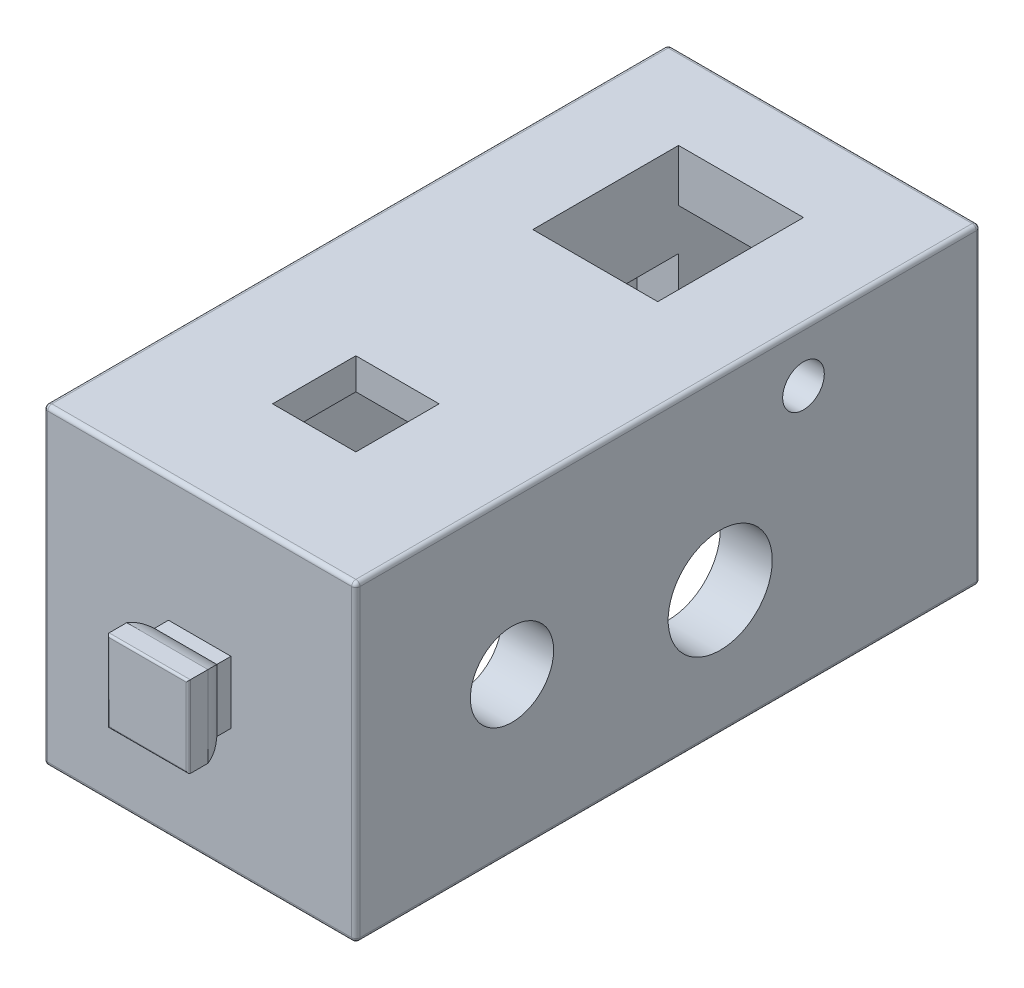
from build123d import *

# Parameters (mm, degrees)
SKETCH_1_W           = 15
SKETCH_1_H           = 15
EXTRUDE_1_DEPTH      = 30
SKETCH_2_W           = 3
SKETCH_2_H           = 3
EXTRUDE_2_DEPTH      = 1
EXTRUDE_3_DEPTH      = 1
EXTRUDE_3_DEPTH_BACK = 4
CUT_EXTRUDE_1_REACH  = 36.847
FILLET_1_R           = 0.1
CUT_EXTRUDE_2_DEPTH  = 13.5
SKETCH_6_W           = 10
SKETCH_6_H           = 8.5
EXTRUDE_4_DEPTH      = 3
SKETCH_7_W           = 6
SKETCH_7_H           = 4
EXTRUDE_5_DEPTH      = 1
SKETCH_8_W           = 6
SKETCH_8_H           = 7
CUT_EXTRUDE_3_DEPTH  = 33.657311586
CUT_EXTRUDE_4_DEPTH  = 13.5
CUT_EXTRUDE_5_REACH  = 36.369
SKETCH_11_W          = 4
SKETCH_11_H          = 4
CUT_EXTRUDE_6_REACH  = 38.742
SKETCH_12_R          = 2.5
SKETCH_12_R_2        = 2
SKETCH_12_R_3        = 1
CUT_EXTRUDE_7_REACH  = 37.795
SKETCH_14_R          = 2
SKETCH_14_R_2        = 1
SKETCH_14_R_3        = 1.25
FILLET_2_R           = 0.2


with BuildPart() as part:
    # Sketch 1 → Extrude 1 (new body)
    with BuildSketch(Plane.XY):
        with Locations((0, 7.5)):
            Rectangle(SKETCH_1_W, SKETCH_1_H)
    extrude(amount=-EXTRUDE_1_DEPTH)

    # Sketch 2 → Extrude 2 (add)
    with BuildSketch(Plane.XY):
        with Locations((0, 7.5)):
            Rectangle(SKETCH_2_W, SKETCH_2_H)
    extrude(amount=EXTRUDE_2_DEPTH)

    # Sketch 3 → Extrude 3 (add, two sides: drawn at the far end of the back side and taken through both)
    with BuildSketch(Plane.XZ.offset(-6).offset(-EXTRUDE_3_DEPTH_BACK)):
        with BuildLine():
            Line((-1.95, 2.5), (1.95, 2.5))
            Line((1.95, 2.5), (1.95, 1.555590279))
            ThreePointArc((1.95, 1.555590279), (1.780042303, 1.088161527), (1.5, 0.677124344))
            Line((1.5, 0.677124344), (-1.5, 0.677124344))
            ThreePointArc((-1.5, 0.677124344), (-1.780042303, 1.088161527), (-1.95, 1.555590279))
            Line((-1.95, 1.555590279), (-1.95, 2.5))
        make_face()
    extrude(amount=EXTRUDE_3_DEPTH + EXTRUDE_3_DEPTH_BACK)

    # Sketch 4 → Cut-Extrude 1 (cut, up to next)
    with BuildSketch(Plane.ZY.offset(1.95), mode=Mode.PRIVATE) as cut_extrude_1_sk1:
        with BuildLine():
            Line((2.5, 9.45), (1.555590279, 9.45))
            ThreePointArc((1.555590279, 9.45), (1.088161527, 9.280042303), (0.677124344, 9))
            Line((0.677124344, 9), (0.677124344, 10))
            Line((0.677124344, 10), (2.5, 10))
            Line((2.5, 10), (2.5, 9.45))
        make_face()
    cut_extrude_1_tool1 = extrude(cut_extrude_1_sk1.sketch, amount=-CUT_EXTRUDE_1_REACH, mode=Mode.PRIVATE) & part.part
    # Sketch 4 → Cut-Extrude 1 (cut, up to next)
    with BuildSketch(Plane.ZY.offset(1.95), mode=Mode.PRIVATE) as cut_extrude_1_sk2:
        with BuildLine():
            Line((2.5, 5.55), (1.555590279, 5.55))
            ThreePointArc((1.555590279, 5.55), (1.088161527, 5.719957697), (0.677124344, 6))
            Line((0.677124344, 6), (0.677124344, 5))
            Line((0.677124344, 5), (2.5, 5))
            Line((2.5, 5), (2.5, 5.55))
        make_face()
    cut_extrude_1_tool2 = extrude(cut_extrude_1_sk2.sketch, amount=-CUT_EXTRUDE_1_REACH, mode=Mode.PRIVATE) & part.part
    add(cut_extrude_1_tool1.solids().sort_by_distance((-1.95, 9.669375, 1.500125))[0], mode=Mode.SUBTRACT)
    add(cut_extrude_1_tool2.solids().sort_by_distance((-1.95, 5.330625, 1.500125))[0], mode=Mode.SUBTRACT)

    # Fillet 1
    fillet_1_edges = [part.edges().sort_by_distance(p)[0] for p in [
        (1.95, 7.5, 2.5),
        (-1.95, 7.5, 2.5),
        (0, 9.45, 2.5),
        (0, 5.55, 2.5),
    ]]
    fillet(fillet_1_edges, radius=FILLET_1_R)

    # Sketch 5 → Cut-Extrude 2 (cut)
    with BuildSketch(Plane.XZ):
        Polygon((-5, -1.5), (5, -1.5), (5, -26), (3, -26), (3, -30), (-3, -30), (-3, -26), (-5, -26), align=None)
    extrude(amount=-CUT_EXTRUDE_2_DEPTH, mode=Mode.SUBTRACT)

    # Sketch 6 → Extrude 4 (add)
    with BuildSketch(Plane.XZ.offset(-13.5)):
        with Locations((0, -21.75)):
            Rectangle(SKETCH_6_W, SKETCH_6_H)
    extrude(amount=EXTRUDE_4_DEPTH)

    # Sketch 7 → Extrude 5 (add)
    with BuildSketch(Plane.XZ.offset(-13.5)):
        with Locations((0, -28)):
            Rectangle(SKETCH_7_W, SKETCH_7_H)
    extrude(amount=EXTRUDE_5_DEPTH)

    # Sketch 8 → Cut-Extrude 3 (cut, through all)
    with BuildSketch(Plane.XZ.offset(-10.5)):
        with Locations((0, -22.5)):
            Rectangle(SKETCH_8_W, SKETCH_8_H)
    extrude(amount=-CUT_EXTRUDE_3_DEPTH, mode=Mode.SUBTRACT)

    # Sketch 10 → Cut-Extrude 4 (cut)
    with BuildSketch(Plane.XZ):
        with BuildLine():
            Line((-5.75, -30), (-5.75, -29.361437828))
            ThreePointArc((-5.75, -29.361437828), (-5, -27.7), (-4.25, -29.361437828))
            Line((-4.25, -29.361437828), (-4.25, -30))
            Line((-4.25, -30), (-5.75, -30))
        make_face()
        with BuildLine():
            Line((5.75, -30), (4.25, -30))
            Line((4.25, -30), (4.25, -29.361437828))
            ThreePointArc((4.25, -29.361437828), (5, -27.7), (5.75, -29.361437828))
            Line((5.75, -29.361437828), (5.75, -30))
        make_face()
    extrude(amount=-CUT_EXTRUDE_4_DEPTH, mode=Mode.SUBTRACT)

    # Sketch 11 → Cut-Extrude 5 (cut, up to next)
    with BuildSketch(Plane(origin=(0, 15, 0), x_dir=(-1, 0, 0), z_dir=(0, 1, 0)), mode=Mode.PRIVATE) as cut_extrude_5_sk1:
        with Locations((0, -7.5)):
            Rectangle(SKETCH_11_W, SKETCH_11_H)
    cut_extrude_5_tool1 = extrude(cut_extrude_5_sk1.sketch, amount=-CUT_EXTRUDE_5_REACH, mode=Mode.PRIVATE) & part.part
    add(cut_extrude_5_tool1.solids().sort_by_distance((0, 15, -7.5))[0], mode=Mode.SUBTRACT)

    # Sketch 12 → Cut-Extrude 6 (cut, up to next)
    with BuildSketch(Plane(origin=(7.5, 0, 0), x_dir=(0, 0, -1), z_dir=(1, 0, 0)), mode=Mode.PRIVATE) as cut_extrude_6_sk1:
        with Locations((17.5, 6)):
            Circle(SKETCH_12_R)
    cut_extrude_6_tool1 = extrude(cut_extrude_6_sk1.sketch, amount=-CUT_EXTRUDE_6_REACH, mode=Mode.PRIVATE) & part.part
    # Sketch 12 → Cut-Extrude 6 (cut, up to next)
    with BuildSketch(Plane(origin=(7.5, 0, 0), x_dir=(0, 0, -1), z_dir=(1, 0, 0)), mode=Mode.PRIVATE) as cut_extrude_6_sk2:
        with Locations((7.5, 7.5)):
            Circle(SKETCH_12_R_2)
    cut_extrude_6_tool2 = extrude(cut_extrude_6_sk2.sketch, amount=-CUT_EXTRUDE_6_REACH, mode=Mode.PRIVATE) & part.part
    # Sketch 12 → Cut-Extrude 6 (cut, up to next)
    with BuildSketch(Plane(origin=(7.5, 0, 0), x_dir=(0, 0, -1), z_dir=(1, 0, 0)), mode=Mode.PRIVATE) as cut_extrude_6_sk3:
        with Locations((21.5, 12.5)):
            Circle(SKETCH_12_R_3)
    cut_extrude_6_tool3 = extrude(cut_extrude_6_sk3.sketch, amount=-CUT_EXTRUDE_6_REACH, mode=Mode.PRIVATE) & part.part
    add(cut_extrude_6_tool1.solids().sort_by_distance((7.5, 6, -17.5))[0], mode=Mode.SUBTRACT)
    add(cut_extrude_6_tool2.solids().sort_by_distance((7.5, 7.5, -7.5))[0], mode=Mode.SUBTRACT)
    add(cut_extrude_6_tool3.solids().sort_by_distance((7.5, 12.5, -21.5))[0], mode=Mode.SUBTRACT)

    # Sketch 14 → Cut-Extrude 7 (cut, up to next)
    with BuildSketch(Plane(origin=(-5, 0, 0), x_dir=(0, 0, -1), z_dir=(1, 0, 0)), mode=Mode.PRIVATE) as cut_extrude_7_sk1:
        with Locations((7.5, 7.5)):
            Circle(SKETCH_14_R)
    cut_extrude_7_tool1 = extrude(cut_extrude_7_sk1.sketch, amount=-CUT_EXTRUDE_7_REACH, mode=Mode.PRIVATE) & part.part
    # Sketch 14 → Cut-Extrude 7 (cut, up to next)
    with BuildSketch(Plane(origin=(-5, 0, 0), x_dir=(0, 0, -1), z_dir=(1, 0, 0)), mode=Mode.PRIVATE) as cut_extrude_7_sk2:
        with Locations((21.5, 12.5)):
            Circle(SKETCH_14_R_2)
    cut_extrude_7_tool2 = extrude(cut_extrude_7_sk2.sketch, amount=-CUT_EXTRUDE_7_REACH, mode=Mode.PRIVATE) & part.part
    # Sketch 14 → Cut-Extrude 7 (cut, up to next)
    with BuildSketch(Plane(origin=(-5, 0, 0), x_dir=(0, 0, -1), z_dir=(1, 0, 0)), mode=Mode.PRIVATE) as cut_extrude_7_sk3:
        with Locations((17.5, 6)):
            Circle(SKETCH_14_R_3)
    cut_extrude_7_tool3 = extrude(cut_extrude_7_sk3.sketch, amount=-CUT_EXTRUDE_7_REACH, mode=Mode.PRIVATE) & part.part
    add(cut_extrude_7_tool1.solids().sort_by_distance((-5, 7.5, -7.5))[0], mode=Mode.SUBTRACT)
    add(cut_extrude_7_tool2.solids().sort_by_distance((-5, 12.5, -21.5))[0], mode=Mode.SUBTRACT)
    add(cut_extrude_7_tool3.solids().sort_by_distance((-5, 6, -17.5))[0], mode=Mode.SUBTRACT)

    # Fillet 2
    fillet_2_edges = [part.edges().sort_by_distance(p)[0] for p in [
        (7.5, 7.5, -30),
        (0, 15, -30),
        (-3.625, 0, -30),
        (-4.25, 6.75, -30),
        (-5.75, 6.75, -30),
        (6.625, 0, -30),
        (5.75, 6.75, -30),
        (4.25, 6.75, -30),
        (-7.5, 7.5, -30),
        (0, 15, 0),
        (7.5, 7.5, 0),
        (0, 0, 0),
        (-7.5, 7.5, 0),
        (-6.625, 0, -30),
        (-7.5, 15, -15),
        (7.5, 15, -15),
        (7.5, 0, -15),
        (-7.5, 0, -15),
        (3.625, 0, -30),
    ]]
    fillet(fillet_2_edges, radius=FILLET_2_R)


solid = part.part
